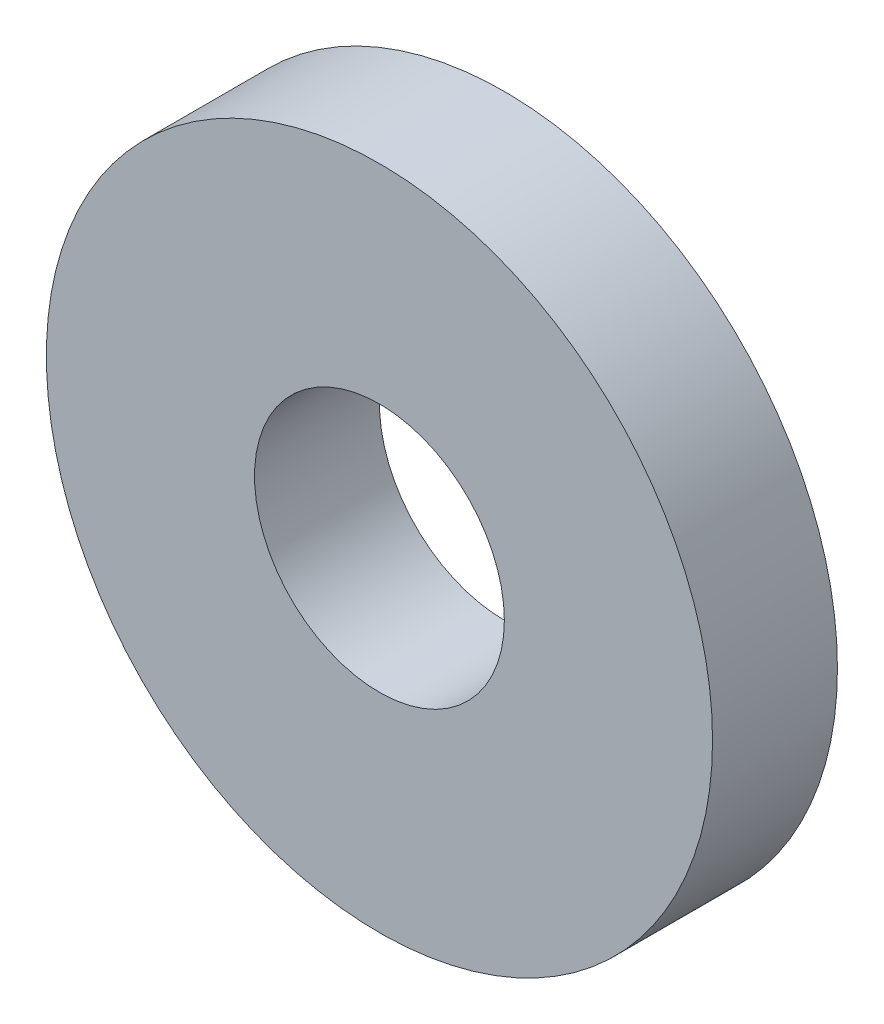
from build123d import *

# Parameters (mm, degrees)
SKETCH1_R      = 80
SKETCH1_R_2    = 30
EXTRUDE1_DEPTH = 30


with BuildPart() as part:
    # Sketch1 → Extrude1 (new body)
    with BuildSketch(Plane.XY):
        with Locations((-396.363758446, -302.221968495)):
            Circle(SKETCH1_R)
        with Locations((-396.363758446, -302.221968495)):
            Circle(SKETCH1_R_2, mode=Mode.SUBTRACT)
    extrude(amount=-EXTRUDE1_DEPTH)


solid = part.part
